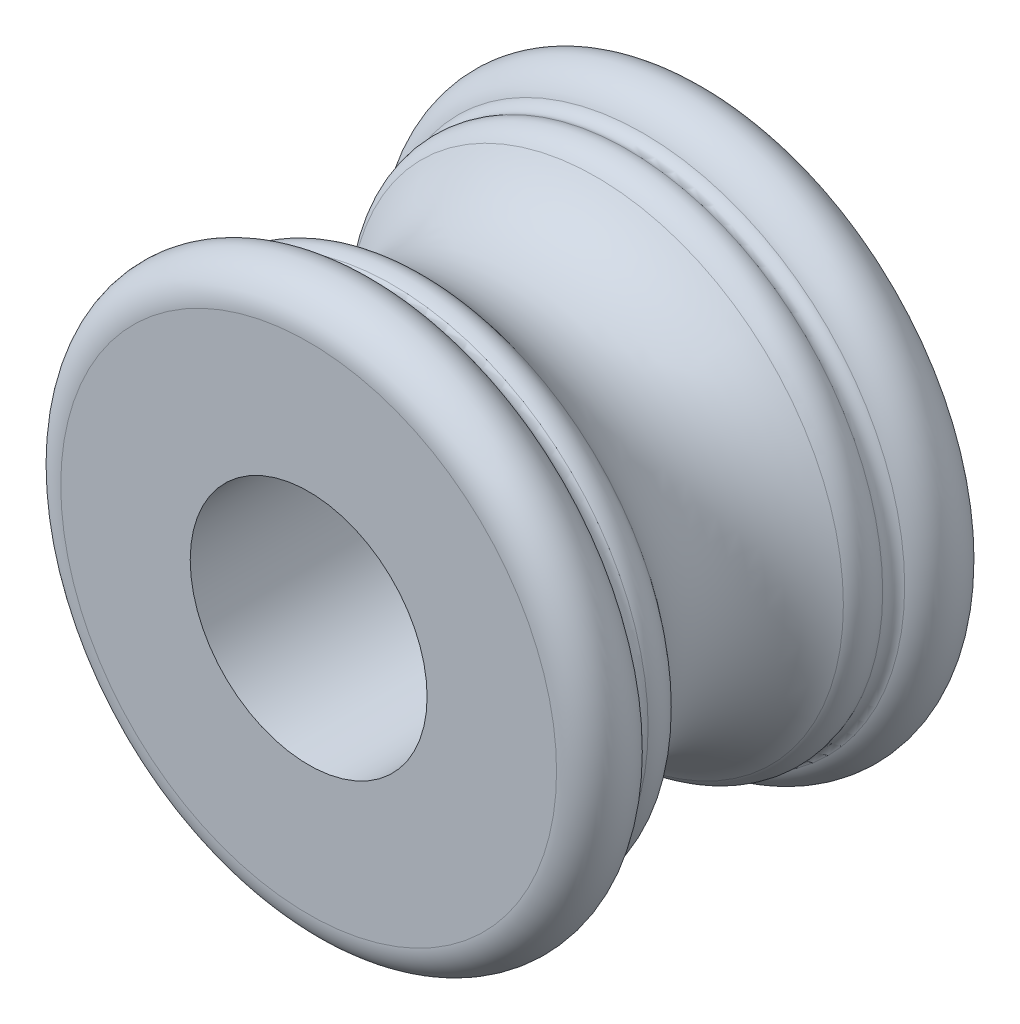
ISO-10303-21;
HEADER;
FILE_DESCRIPTION(('STEP AP214'),'2;1');
FILE_NAME('part.step','',(''),(''),'','','');
FILE_SCHEMA(('AUTOMOTIVE_DESIGN { 1 0 10303 214 1 1 1 1 }'));
ENDSEC;
DATA;
#1=APPLICATION_CONTEXT('core data for automotive mechanical design processes');
#2=APPLICATION_PROTOCOL_DEFINITION('international standard','automotive_design',2000,#1);
#3=PRODUCT_CONTEXT('',#1,'mechanical');
#4=PRODUCT('Part','Part','',(#3));
#5=PRODUCT_RELATED_PRODUCT_CATEGORY('part','',(#4));
#6=PRODUCT_DEFINITION_FORMATION('','',#4);
#7=PRODUCT_DEFINITION_CONTEXT('part definition',#1,'design');
#8=PRODUCT_DEFINITION('design','',#6,#7);
#9=PRODUCT_DEFINITION_SHAPE('','',#8);
#10=(LENGTH_UNIT() NAMED_UNIT(*) SI_UNIT(.MILLI.,.METRE.));
#11=(NAMED_UNIT(*) PLANE_ANGLE_UNIT() SI_UNIT($,.RADIAN.));
#12=(NAMED_UNIT(*) SI_UNIT($,.STERADIAN.) SOLID_ANGLE_UNIT());
#13=UNCERTAINTY_MEASURE_WITH_UNIT(LENGTH_MEASURE(1.E-05),#10,'distance_accuracy_value','');
#14=(GEOMETRIC_REPRESENTATION_CONTEXT(3) GLOBAL_UNCERTAINTY_ASSIGNED_CONTEXT((#13)) GLOBAL_UNIT_ASSIGNED_CONTEXT((#10,
#11,#12)) REPRESENTATION_CONTEXT('',''));
#15=CARTESIAN_POINT('',(0.,0.,0.));
#16=DIRECTION('',(0.,0.,1.));
#17=DIRECTION('',(1.,0.,0.));
#18=AXIS2_PLACEMENT_3D('',#15,#16,#17);
#19=CARTESIAN_POINT('',(0.,0.,-13.6553967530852));
#20=DIRECTION('',(0.,0.,1.));
#21=DIRECTION('',(1.,0.,0.));
#22=AXIS2_PLACEMENT_3D('',#19,#20,#21);
#23=TOROIDAL_SURFACE('',#22,11.2379416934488,0.5);
#24=CARTESIAN_POINT('',(0.,0.,-13.4511938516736));
#25=DIRECTION('',(0.,0.,1.));
#26=DIRECTION('',(1.,0.,0.));
#27=AXIS2_PLACEMENT_3D('',#24,#25,#26);
#28=CIRCLE('',#27,10.7815414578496);
#29=CARTESIAN_POINT('',(10.7815414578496,0.,-13.4511938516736));
#30=VERTEX_POINT('',#29);
#31=EDGE_CURVE('E63',#30,#30,#28,.T.);
#32=ORIENTED_EDGE('',*,*,#31,.F.);
#33=EDGE_LOOP('',(#32));
#34=FACE_BOUND('',#33,.T.);
#35=CARTESIAN_POINT('',(0.,0.,-14.1165475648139));
#36=DIRECTION('',(0.,0.,1.));
#37=DIRECTION('',(1.,0.,0.));
#38=AXIS2_PLACEMENT_3D('',#35,#36,#37);
#39=CIRCLE('',#38,11.0447062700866);
#40=CARTESIAN_POINT('',(11.0447062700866,0.,-14.1165475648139));
#41=VERTEX_POINT('',#40);
#42=EDGE_CURVE('E10',#41,#41,#39,.T.);
#43=ORIENTED_EDGE('',*,*,#42,.T.);
#44=EDGE_LOOP('',(#43));
#45=FACE_BOUND('',#44,.T.);
#46=ADVANCED_FACE('F29',(#34,#45),#23,.F.);
#47=CARTESIAN_POINT('',(0.,0.,-15.5));
#48=DIRECTION('',(0.,0.,1.));
#49=DIRECTION('',(1.,0.,0.));
#50=AXIS2_PLACEMENT_3D('',#47,#48,#49);
#51=TOROIDAL_SURFACE('',#50,10.465,1.5);
#52=ORIENTED_EDGE('',*,*,#42,.F.);
#53=EDGE_LOOP('',(#52));
#54=FACE_BOUND('',#53,.T.);
#55=CARTESIAN_POINT('',(0.,0.,-17.));
#56=DIRECTION('',(0.,0.,1.));
#57=DIRECTION('',(1.,0.,0.));
#58=AXIS2_PLACEMENT_3D('',#55,#56,#57);
#59=CIRCLE('',#58,10.465);
#60=CARTESIAN_POINT('',(10.465,0.,-17.));
#61=VERTEX_POINT('',#60);
#62=EDGE_CURVE('E35',#61,#61,#59,.T.);
#63=ORIENTED_EDGE('',*,*,#62,.T.);
#64=EDGE_LOOP('',(#63));
#65=FACE_BOUND('',#64,.T.);
#66=ADVANCED_FACE('F70',(#54,#65),#51,.T.);
#67=CARTESIAN_POINT('',(0.,10.465,-17.));
#68=DIRECTION('',(0.,0.,1.));
#69=DIRECTION('',(1.,0.,0.));
#70=AXIS2_PLACEMENT_3D('',#67,#68,#69);
#71=PLANE('',#70);
#72=ORIENTED_EDGE('',*,*,#62,.F.);
#73=EDGE_LOOP('',(#72));
#74=FACE_BOUND('',#73,.T.);
#75=CARTESIAN_POINT('',(0.,0.,-17.));
#76=DIRECTION('',(0.,0.,1.));
#77=DIRECTION('',(1.,0.,0.));
#78=AXIS2_PLACEMENT_3D('',#75,#76,#77);
#79=CIRCLE('',#78,5.);
#80=CARTESIAN_POINT('',(5.,0.,-17.));
#81=VERTEX_POINT('',#80);
#82=EDGE_CURVE('E39',#81,#81,#79,.T.);
#83=ORIENTED_EDGE('',*,*,#82,.T.);
#84=EDGE_LOOP('',(#83));
#85=FACE_BOUND('',#84,.T.);
#86=ADVANCED_FACE('F74',(#74,#85),#71,.F.);
#87=CARTESIAN_POINT('',(0.,0.,7.07917110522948));
#88=DIRECTION('',(0.,0.,1.));
#89=DIRECTION('',(1.,0.,0.));
#90=AXIS2_PLACEMENT_3D('',#87,#88,#89);
#91=CYLINDRICAL_SURFACE('',#90,5.);
#92=ORIENTED_EDGE('',*,*,#82,.F.);
#93=EDGE_LOOP('',(#92));
#94=FACE_BOUND('',#93,.T.);
#95=CARTESIAN_POINT('',(0.,0.,0.));
#96=DIRECTION('',(0.,0.,1.));
#97=DIRECTION('',(1.,0.,0.));
#98=AXIS2_PLACEMENT_3D('',#95,#96,#97);
#99=CIRCLE('',#98,5.);
#100=CARTESIAN_POINT('',(5.,0.,0.));
#101=VERTEX_POINT('',#100);
#102=EDGE_CURVE('E43',#101,#101,#99,.T.);
#103=ORIENTED_EDGE('',*,*,#102,.T.);
#104=EDGE_LOOP('',(#103));
#105=FACE_BOUND('',#104,.T.);
#106=ADVANCED_FACE('F79',(#94,#105),#91,.F.);
#107=CARTESIAN_POINT('',(0.,10.465,0.));
#108=DIRECTION('',(0.,0.,-1.));
#109=DIRECTION('',(-1.,0.,0.));
#110=AXIS2_PLACEMENT_3D('',#107,#108,#109);
#111=PLANE('',#110);
#112=ORIENTED_EDGE('',*,*,#102,.F.);
#113=EDGE_LOOP('',(#112));
#114=FACE_BOUND('',#113,.T.);
#115=CARTESIAN_POINT('',(0.,0.,0.));
#116=DIRECTION('',(0.,0.,1.));
#117=DIRECTION('',(1.,0.,0.));
#118=AXIS2_PLACEMENT_3D('',#115,#116,#117);
#119=CIRCLE('',#118,10.465);
#120=CARTESIAN_POINT('',(10.465,0.,0.));
#121=VERTEX_POINT('',#120);
#122=EDGE_CURVE('E48',#121,#121,#119,.T.);
#123=ORIENTED_EDGE('',*,*,#122,.T.);
#124=EDGE_LOOP('',(#123));
#125=FACE_BOUND('',#124,.T.);
#126=ADVANCED_FACE('F85',(#114,#125),#111,.F.);
#127=CARTESIAN_POINT('',(0.,0.,-1.5));
#128=DIRECTION('',(0.,0.,1.));
#129=DIRECTION('',(1.,0.,0.));
#130=AXIS2_PLACEMENT_3D('',#127,#128,#129);
#131=TOROIDAL_SURFACE('',#130,10.465,1.5);
#132=ORIENTED_EDGE('',*,*,#122,.F.);
#133=EDGE_LOOP('',(#132));
#134=FACE_BOUND('',#133,.T.);
#135=CARTESIAN_POINT('',(0.,0.,-2.88345243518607));
#136=DIRECTION('',(0.,0.,1.));
#137=DIRECTION('',(1.,0.,0.));
#138=AXIS2_PLACEMENT_3D('',#135,#136,#137);
#139=CIRCLE('',#138,11.0447062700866);
#140=CARTESIAN_POINT('',(11.0447062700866,0.,-2.88345243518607));
#141=VERTEX_POINT('',#140);
#142=EDGE_CURVE('E51',#141,#141,#139,.T.);
#143=ORIENTED_EDGE('',*,*,#142,.T.);
#144=EDGE_LOOP('',(#143));
#145=FACE_BOUND('',#144,.T.);
#146=ADVANCED_FACE('F89',(#134,#145),#131,.T.);
#147=CARTESIAN_POINT('',(0.,0.,-3.34460324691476));
#148=DIRECTION('',(0.,0.,1.));
#149=DIRECTION('',(1.,0.,0.));
#150=AXIS2_PLACEMENT_3D('',#147,#148,#149);
#151=TOROIDAL_SURFACE('',#150,11.2379416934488,0.5);
#152=ORIENTED_EDGE('',*,*,#142,.F.);
#153=EDGE_LOOP('',(#152));
#154=FACE_BOUND('',#153,.T.);
#155=CARTESIAN_POINT('',(0.,0.,-3.54880614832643));
#156=DIRECTION('',(0.,0.,1.));
#157=DIRECTION('',(1.,0.,0.));
#158=AXIS2_PLACEMENT_3D('',#155,#156,#157);
#159=CIRCLE('',#158,10.7815414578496);
#160=CARTESIAN_POINT('',(10.7815414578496,0.,-3.54880614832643));
#161=VERTEX_POINT('',#160);
#162=EDGE_CURVE('E54',#161,#161,#159,.T.);
#163=ORIENTED_EDGE('',*,*,#162,.T.);
#164=EDGE_LOOP('',(#163));
#165=FACE_BOUND('',#164,.T.);
#166=ADVANCED_FACE('F93',(#154,#165),#151,.F.);
#167=CARTESIAN_POINT('',(0.,0.,-3.98796808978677));
#168=DIRECTION('',(0.,0.,1.));
#169=DIRECTION('',(1.,0.,0.));
#170=AXIS2_PLACEMENT_3D('',#167,#168,#169);
#171=TOROIDAL_SURFACE('',#170,9.8,1.07530779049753);
#172=ORIENTED_EDGE('',*,*,#162,.F.);
#173=EDGE_LOOP('',(#172));
#174=FACE_BOUND('',#173,.T.);
#175=CARTESIAN_POINT('',(0.,0.,-4.85820220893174));
#176=DIRECTION('',(0.,0.,1.));
#177=DIRECTION('',(1.,0.,0.));
#178=AXIS2_PLACEMENT_3D('',#175,#176,#177);
#179=CIRCLE('',#178,10.4316481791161);
#180=CARTESIAN_POINT('',(10.4316481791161,0.,-4.85820220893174));
#181=VERTEX_POINT('',#180);
#182=EDGE_CURVE('E57',#181,#181,#179,.T.);
#183=ORIENTED_EDGE('',*,*,#182,.T.);
#184=EDGE_LOOP('',(#183));
#185=FACE_BOUND('',#184,.T.);
#186=ADVANCED_FACE('F97',(#174,#185),#171,.T.);
#187=CARTESIAN_POINT('',(0.,0.,-8.5));
#188=DIRECTION('',(0.,0.,1.));
#189=DIRECTION('',(1.,0.,0.));
#190=AXIS2_PLACEMENT_3D('',#187,#188,#189);
#191=TOROIDAL_SURFACE('',#190,13.075,4.5);
#192=ORIENTED_EDGE('',*,*,#182,.F.);
#193=EDGE_LOOP('',(#192));
#194=FACE_BOUND('',#193,.T.);
#195=CARTESIAN_POINT('',(0.,0.,-12.1417977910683));
#196=DIRECTION('',(0.,0.,1.));
#197=DIRECTION('',(1.,0.,0.));
#198=AXIS2_PLACEMENT_3D('',#195,#196,#197);
#199=CIRCLE('',#198,10.4316481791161);
#200=CARTESIAN_POINT('',(10.4316481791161,0.,-12.1417977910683));
#201=VERTEX_POINT('',#200);
#202=EDGE_CURVE('E60',#201,#201,#199,.T.);
#203=ORIENTED_EDGE('',*,*,#202,.T.);
#204=EDGE_LOOP('',(#203));
#205=FACE_BOUND('',#204,.T.);
#206=ADVANCED_FACE('F101',(#194,#205),#191,.F.);
#207=CARTESIAN_POINT('',(0.,0.,-13.0120319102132));
#208=DIRECTION('',(0.,0.,1.));
#209=DIRECTION('',(1.,0.,0.));
#210=AXIS2_PLACEMENT_3D('',#207,#208,#209);
#211=TOROIDAL_SURFACE('',#210,9.8,1.07530779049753);
#212=ORIENTED_EDGE('',*,*,#202,.F.);
#213=EDGE_LOOP('',(#212));
#214=FACE_BOUND('',#213,.T.);
#215=ORIENTED_EDGE('',*,*,#31,.T.);
#216=EDGE_LOOP('',(#215));
#217=FACE_BOUND('',#216,.T.);
#218=ADVANCED_FACE('F67',(#214,#217),#211,.T.);
#219=CLOSED_SHELL('',(#46,#66,#86,#106,#126,#146,#166,#186,#206,#218));
#220=MANIFOLD_SOLID_BREP('B2',#219);
#221=ADVANCED_BREP_SHAPE_REPRESENTATION('',(#18,#220),#14);
#222=SHAPE_DEFINITION_REPRESENTATION(#9,#221);
ENDSEC;
END-ISO-10303-21;
